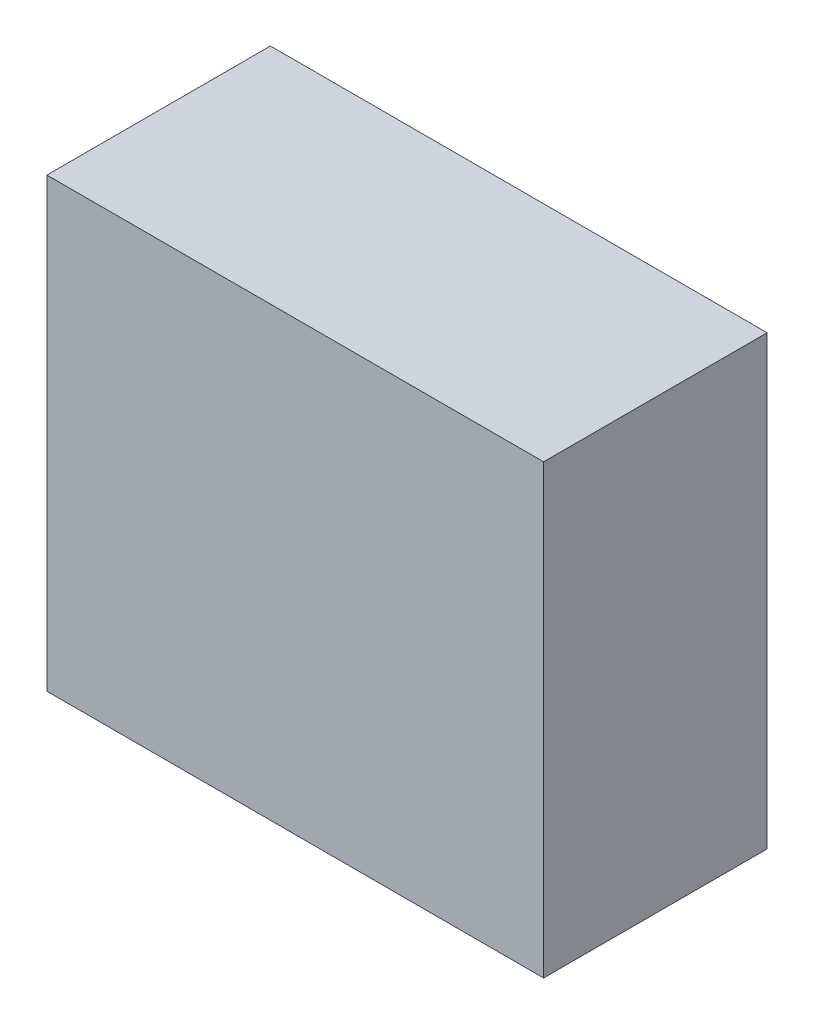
ISO-10303-21;
HEADER;
FILE_DESCRIPTION(('STEP AP214'),'2;1');
FILE_NAME('part.step','',(''),(''),'','','');
FILE_SCHEMA(('AUTOMOTIVE_DESIGN { 1 0 10303 214 1 1 1 1 }'));
ENDSEC;
DATA;
#1=APPLICATION_CONTEXT('core data for automotive mechanical design processes');
#2=APPLICATION_PROTOCOL_DEFINITION('international standard','automotive_design',2000,#1);
#3=PRODUCT_CONTEXT('',#1,'mechanical');
#4=PRODUCT('Part','Part','',(#3));
#5=PRODUCT_RELATED_PRODUCT_CATEGORY('part','',(#4));
#6=PRODUCT_DEFINITION_FORMATION('','',#4);
#7=PRODUCT_DEFINITION_CONTEXT('part definition',#1,'design');
#8=PRODUCT_DEFINITION('design','',#6,#7);
#9=PRODUCT_DEFINITION_SHAPE('','',#8);
#10=(LENGTH_UNIT() NAMED_UNIT(*) SI_UNIT(.MILLI.,.METRE.));
#11=(NAMED_UNIT(*) PLANE_ANGLE_UNIT() SI_UNIT($,.RADIAN.));
#12=(NAMED_UNIT(*) SI_UNIT($,.STERADIAN.) SOLID_ANGLE_UNIT());
#13=UNCERTAINTY_MEASURE_WITH_UNIT(LENGTH_MEASURE(1.E-05),#10,'distance_accuracy_value','');
#14=(GEOMETRIC_REPRESENTATION_CONTEXT(3) GLOBAL_UNCERTAINTY_ASSIGNED_CONTEXT((#13)) GLOBAL_UNIT_ASSIGNED_CONTEXT((#10,
#11,#12)) REPRESENTATION_CONTEXT('',''));
#15=CARTESIAN_POINT('',(0.,0.,0.));
#16=DIRECTION('',(0.,0.,1.));
#17=DIRECTION('',(1.,0.,0.));
#18=AXIS2_PLACEMENT_3D('',#15,#16,#17);
#19=CARTESIAN_POINT('',(0.499999,0.4499991,0.4499991));
#20=DIRECTION('',(0.,0.,1.));
#21=DIRECTION('',(1.,0.,0.));
#22=AXIS2_PLACEMENT_3D('',#19,#20,#21);
#23=PLANE('',#22);
#24=DIRECTION('',(1.,0.,0.));
#25=VECTOR('',#24,1.);
#26=CARTESIAN_POINT('',(0.499999,-0.4499991,0.4499991));
#27=LINE('',#26,#25);
#28=CARTESIAN_POINT('',(0.499999,-0.4499991,0.4499991));
#29=VERTEX_POINT('',#28);
#30=CARTESIAN_POINT('',(-0.499999,-0.4499991,0.4499991));
#31=VERTEX_POINT('',#30);
#32=EDGE_CURVE('E52',#29,#31,#27,.F.);
#33=ORIENTED_EDGE('',*,*,#32,.F.);
#34=DIRECTION('',(0.,1.,0.));
#35=VECTOR('',#34,1.);
#36=CARTESIAN_POINT('',(0.499999,0.4499991,0.4499991));
#37=LINE('',#36,#35);
#38=CARTESIAN_POINT('',(0.499999,0.4499991,0.4499991));
#39=VERTEX_POINT('',#38);
#40=EDGE_CURVE('E67',#39,#29,#37,.F.);
#41=ORIENTED_EDGE('',*,*,#40,.F.);
#42=DIRECTION('',(1.,0.,0.));
#43=VECTOR('',#42,1.);
#44=CARTESIAN_POINT('',(-0.499999,0.4499991,0.4499991));
#45=LINE('',#44,#43);
#46=CARTESIAN_POINT('',(-0.499999,0.4499991,0.4499991));
#47=VERTEX_POINT('',#46);
#48=EDGE_CURVE('E19',#47,#39,#45,.T.);
#49=ORIENTED_EDGE('',*,*,#48,.F.);
#50=DIRECTION('',(0.,1.,0.));
#51=VECTOR('',#50,1.);
#52=CARTESIAN_POINT('',(-0.499999,-0.4499991,0.4499991));
#53=LINE('',#52,#51);
#54=EDGE_CURVE('E57',#31,#47,#53,.T.);
#55=ORIENTED_EDGE('',*,*,#54,.F.);
#56=EDGE_LOOP('',(#33,#41,#49,#55));
#57=FACE_BOUND('',#56,.T.);
#58=ADVANCED_FACE('F16',(#57),#23,.T.);
#59=CARTESIAN_POINT('',(-0.499999,0.4499991,0.));
#60=DIRECTION('',(0.,1.,0.));
#61=DIRECTION('',(0.,0.,1.));
#62=AXIS2_PLACEMENT_3D('',#59,#60,#61);
#63=PLANE('',#62);
#64=DIRECTION('',(0.,0.,-1.));
#65=VECTOR('',#64,1.);
#66=CARTESIAN_POINT('',(0.499999,0.4499991,0.));
#67=LINE('',#66,#65);
#68=CARTESIAN_POINT('',(0.499999,0.4499991,0.));
#69=VERTEX_POINT('',#68);
#70=EDGE_CURVE('E78',#69,#39,#67,.F.);
#71=ORIENTED_EDGE('',*,*,#70,.F.);
#72=DIRECTION('',(1.,0.,0.));
#73=VECTOR('',#72,1.);
#74=CARTESIAN_POINT('',(0.499999,0.4499991,0.));
#75=LINE('',#74,#73);
#76=CARTESIAN_POINT('',(-0.499999,0.4499991,0.));
#77=VERTEX_POINT('',#76);
#78=EDGE_CURVE('E73',#69,#77,#75,.F.);
#79=ORIENTED_EDGE('',*,*,#78,.T.);
#80=DIRECTION('',(0.,0.,1.));
#81=VECTOR('',#80,1.);
#82=CARTESIAN_POINT('',(-0.499999,0.4499991,0.));
#83=LINE('',#82,#81);
#84=EDGE_CURVE('E62',#47,#77,#83,.F.);
#85=ORIENTED_EDGE('',*,*,#84,.F.);
#86=ORIENTED_EDGE('',*,*,#48,.T.);
#87=EDGE_LOOP('',(#71,#79,#85,#86));
#88=FACE_BOUND('',#87,.T.);
#89=ADVANCED_FACE('F72',(#88),#63,.T.);
#90=CARTESIAN_POINT('',(-0.499999,-0.4499991,0.));
#91=DIRECTION('',(-1.,0.,0.));
#92=DIRECTION('',(0.,0.,1.));
#93=AXIS2_PLACEMENT_3D('',#90,#91,#92);
#94=PLANE('',#93);
#95=ORIENTED_EDGE('',*,*,#84,.T.);
#96=DIRECTION('',(0.,1.,0.));
#97=VECTOR('',#96,1.);
#98=CARTESIAN_POINT('',(-0.499999,0.4499991,0.));
#99=LINE('',#98,#97);
#100=CARTESIAN_POINT('',(-0.499999,-0.4499991,0.));
#101=VERTEX_POINT('',#100);
#102=EDGE_CURVE('E83',#77,#101,#99,.F.);
#103=ORIENTED_EDGE('',*,*,#102,.T.);
#104=DIRECTION('',(0.,0.,-1.));
#105=VECTOR('',#104,1.);
#106=CARTESIAN_POINT('',(-0.499999,-0.4499991,0.));
#107=LINE('',#106,#105);
#108=EDGE_CURVE('E64',#31,#101,#107,.T.);
#109=ORIENTED_EDGE('',*,*,#108,.F.);
#110=ORIENTED_EDGE('',*,*,#54,.T.);
#111=EDGE_LOOP('',(#95,#103,#109,#110));
#112=FACE_BOUND('',#111,.T.);
#113=ADVANCED_FACE('F59',(#112),#94,.T.);
#114=CARTESIAN_POINT('',(0.499999,-0.4499991,0.));
#115=DIRECTION('',(0.,-1.,0.));
#116=DIRECTION('',(0.,0.,-1.));
#117=AXIS2_PLACEMENT_3D('',#114,#115,#116);
#118=PLANE('',#117);
#119=ORIENTED_EDGE('',*,*,#108,.T.);
#120=DIRECTION('',(1.,0.,0.));
#121=VECTOR('',#120,1.);
#122=CARTESIAN_POINT('',(0.499999,-0.4499991,0.));
#123=LINE('',#122,#121);
#124=CARTESIAN_POINT('',(0.499999,-0.4499991,0.));
#125=VERTEX_POINT('',#124);
#126=EDGE_CURVE('E25',#101,#125,#123,.T.);
#127=ORIENTED_EDGE('',*,*,#126,.T.);
#128=DIRECTION('',(0.,0.,-1.));
#129=VECTOR('',#128,1.);
#130=CARTESIAN_POINT('',(0.499999,-0.4499991,0.));
#131=LINE('',#130,#129);
#132=EDGE_CURVE('E33',#29,#125,#131,.T.);
#133=ORIENTED_EDGE('',*,*,#132,.F.);
#134=ORIENTED_EDGE('',*,*,#32,.T.);
#135=EDGE_LOOP('',(#119,#127,#133,#134));
#136=FACE_BOUND('',#135,.T.);
#137=ADVANCED_FACE('F87',(#136),#118,.T.);
#138=CARTESIAN_POINT('',(0.499999,0.4499991,0.));
#139=DIRECTION('',(1.,0.,0.));
#140=DIRECTION('',(0.,0.,-1.));
#141=AXIS2_PLACEMENT_3D('',#138,#139,#140);
#142=PLANE('',#141);
#143=ORIENTED_EDGE('',*,*,#132,.T.);
#144=DIRECTION('',(0.,1.,0.));
#145=VECTOR('',#144,1.);
#146=CARTESIAN_POINT('',(0.499999,0.4499991,0.));
#147=LINE('',#146,#145);
#148=EDGE_CURVE('E11',#125,#69,#147,.T.);
#149=ORIENTED_EDGE('',*,*,#148,.T.);
#150=ORIENTED_EDGE('',*,*,#70,.T.);
#151=ORIENTED_EDGE('',*,*,#40,.T.);
#152=EDGE_LOOP('',(#143,#149,#150,#151));
#153=FACE_BOUND('',#152,.T.);
#154=ADVANCED_FACE('F90',(#153),#142,.T.);
#155=CARTESIAN_POINT('',(0.499999,0.4499991,0.));
#156=DIRECTION('',(0.,0.,1.));
#157=DIRECTION('',(1.,0.,0.));
#158=AXIS2_PLACEMENT_3D('',#155,#156,#157);
#159=PLANE('',#158);
#160=ORIENTED_EDGE('',*,*,#126,.F.);
#161=ORIENTED_EDGE('',*,*,#102,.F.);
#162=ORIENTED_EDGE('',*,*,#78,.F.);
#163=ORIENTED_EDGE('',*,*,#148,.F.);
#164=EDGE_LOOP('',(#160,#161,#162,#163));
#165=FACE_BOUND('',#164,.T.);
#166=ADVANCED_FACE('F89',(#165),#159,.F.);
#167=CLOSED_SHELL('',(#58,#89,#113,#137,#154,#166));
#168=MANIFOLD_SOLID_BREP('B1',#167);
#169=ADVANCED_BREP_SHAPE_REPRESENTATION('',(#18,#168),#14);
#170=SHAPE_DEFINITION_REPRESENTATION(#9,#169);
ENDSEC;
END-ISO-10303-21;
